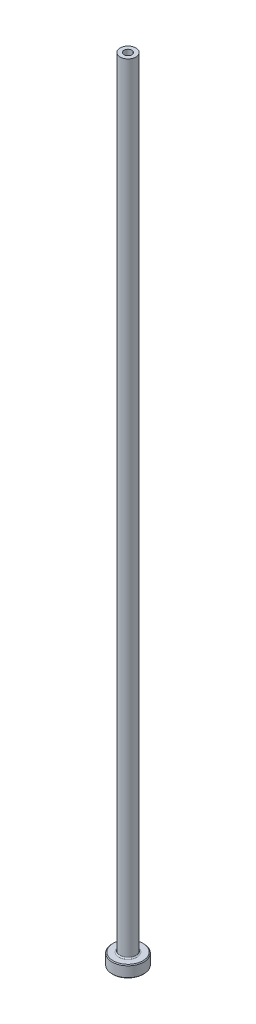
from build123d import *

# Parameters (mm, degrees)
FILLET1_R     = 0.3
CHAMFER1_SIZE = 0.2
CHAMFER3_SIZE = 0.5


with BuildPart() as part:
    # Sketch1 → Revolve1 (revolve)
    with BuildSketch(Plane.XY, mode=Mode.PRIVATE) as revolve1_sk:
        Polygon((-1, 200), (-2, 200), (-2, 3), (-4, 3), (-4, 0), (-1.25, 0), (-1.25, 153), (-1, 165), align=None)
    revolve(revolve1_sk.sketch.rotate(Axis((0, 92.187680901, 0), (0, -1, 0)), 270), axis=Axis((0, 92.187680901, 0), (0, -1, 0)))

    # Fillet1
    fillet1_edges = [part.edges().sort_by_distance(p)[0] for p in [
        (0, 3, -2),
    ]]
    fillet(fillet1_edges, radius=FILLET1_R)

    # Chamfer1
    chamfer1_edges = [part.edges().sort_by_distance(p)[0] for p in [
        (0, 0, -4),
        (0, 3, -4),
    ]]
    chamfer(chamfer1_edges, length=CHAMFER1_SIZE)

    # Chamfer3
    chamfer3_edges = [part.edges().sort_by_distance(p)[0] for p in [
        (0, 0, -1.25),
    ]]
    chamfer(chamfer3_edges, length=CHAMFER3_SIZE)


solid = part.part
